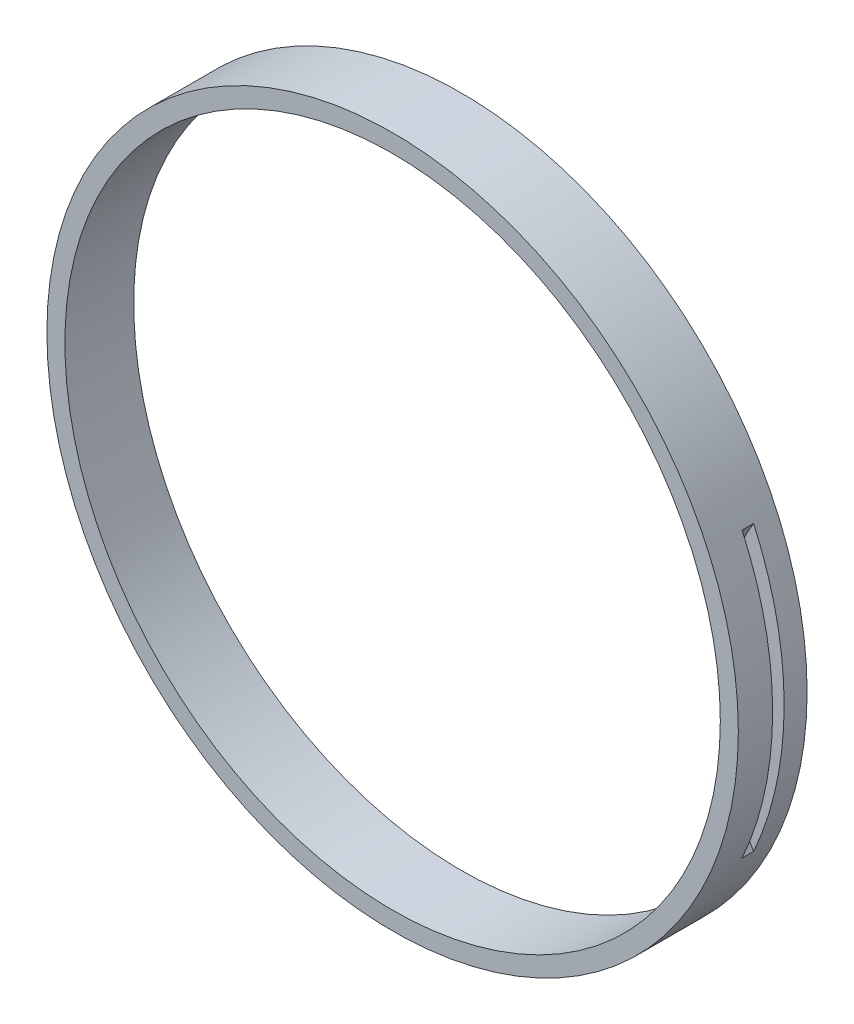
from build123d import *

# Parameters (mm, degrees)
SKETCH_1_R          = 23.876
SKETCH_1_R_2        = 22.6314
EXTRUDE_1_DEPTH     = 4.7498
CUT_EXTRUDE_START   = -1.5875
SKETCH_3_R          = 19.05
CUT_EXTRUDE_2_DEPTH = 0.79375


with BuildPart() as part:
    # Sketch 1 → Extrude 1 (new body)
    with BuildSketch(Plane.XY):
        Circle(SKETCH_1_R)
        Circle(SKETCH_1_R_2, mode=Mode.SUBTRACT)
    extrude(amount=EXTRUDE_1_DEPTH)

    # Sketch 3 → Cut-Extrude 2 (cut)
    with BuildSketch(Plane(origin=(0, 0, 0), x_dir=(-1, 0, 0), z_dir=(0, 0, -1)).offset(CUT_EXTRUDE_START)):
        with Locations((-38.1, 0)):
            Circle(SKETCH_3_R)
    extrude(amount=-CUT_EXTRUDE_2_DEPTH, mode=Mode.SUBTRACT)


solid = part.part
